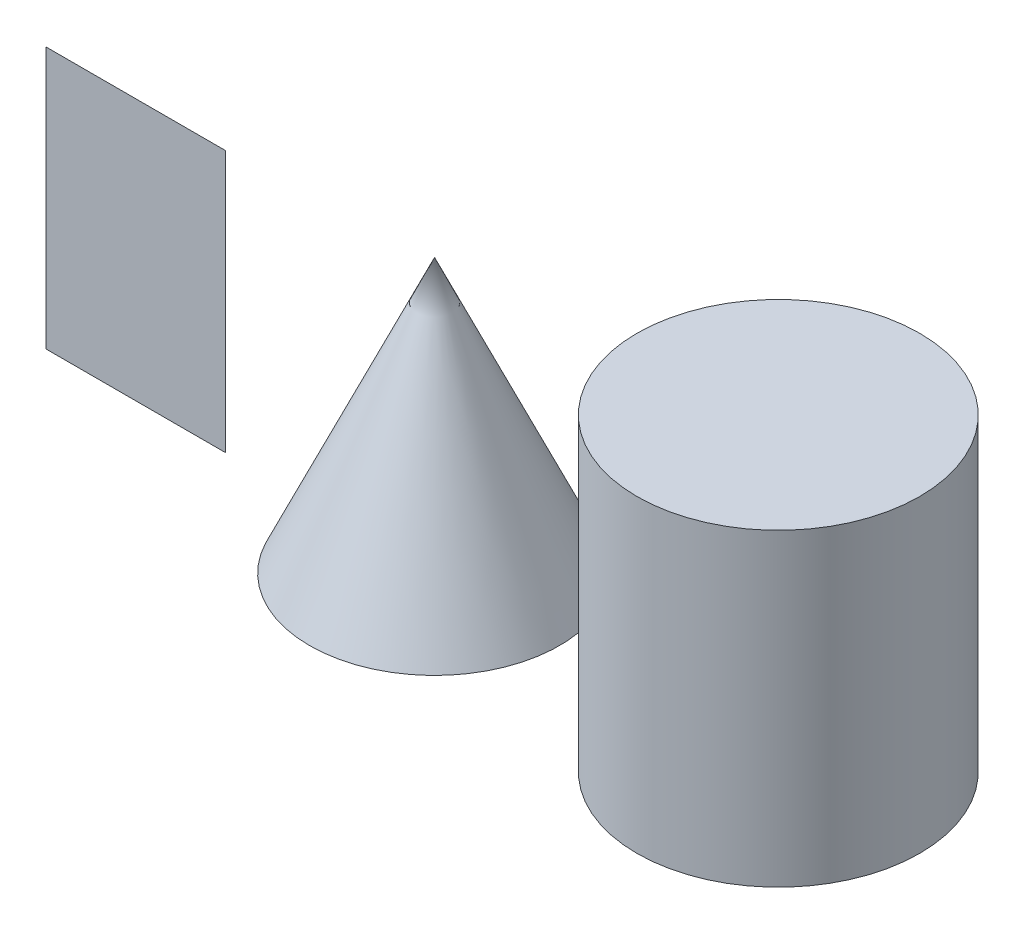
ISO-10303-21;
HEADER;
FILE_DESCRIPTION(('STEP AP214'),'2;1');
FILE_NAME('part.step','',(''),(''),'','','');
FILE_SCHEMA(('AUTOMOTIVE_DESIGN { 1 0 10303 214 1 1 1 1 }'));
ENDSEC;
DATA;
#1=APPLICATION_CONTEXT('core data for automotive mechanical design processes');
#2=APPLICATION_PROTOCOL_DEFINITION('international standard','automotive_design',2000,#1);
#3=PRODUCT_CONTEXT('',#1,'mechanical');
#4=PRODUCT('Part','Part','',(#3));
#5=PRODUCT_RELATED_PRODUCT_CATEGORY('part','',(#4));
#6=PRODUCT_DEFINITION_FORMATION('','',#4);
#7=PRODUCT_DEFINITION_CONTEXT('part definition',#1,'design');
#8=PRODUCT_DEFINITION('design','',#6,#7);
#9=PRODUCT_DEFINITION_SHAPE('','',#8);
#10=(LENGTH_UNIT() NAMED_UNIT(*) SI_UNIT(.MILLI.,.METRE.));
#11=(NAMED_UNIT(*) PLANE_ANGLE_UNIT() SI_UNIT($,.RADIAN.));
#12=(NAMED_UNIT(*) SI_UNIT($,.STERADIAN.) SOLID_ANGLE_UNIT());
#13=UNCERTAINTY_MEASURE_WITH_UNIT(LENGTH_MEASURE(1.E-05),#10,'distance_accuracy_value','');
#14=(GEOMETRIC_REPRESENTATION_CONTEXT(3) GLOBAL_UNCERTAINTY_ASSIGNED_CONTEXT((#13)) GLOBAL_UNIT_ASSIGNED_CONTEXT((#10,
#11,#12)) REPRESENTATION_CONTEXT('',''));
#15=CARTESIAN_POINT('',(0.,0.,0.));
#16=DIRECTION('',(0.,0.,1.));
#17=DIRECTION('',(1.,0.,0.));
#18=AXIS2_PLACEMENT_3D('',#15,#16,#17);
#19=CARTESIAN_POINT('',(114.659475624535,0.,0.));
#20=DIRECTION('',(0.,-1.,0.));
#21=DIRECTION('',(0.,0.,-1.));
#22=AXIS2_PLACEMENT_3D('',#19,#20,#21);
#23=PLANE('',#22);
#24=CARTESIAN_POINT('',(114.659475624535,0.,0.));
#25=DIRECTION('',(0.,1.,0.));
#26=DIRECTION('',(0.,0.,1.));
#27=AXIS2_PLACEMENT_3D('',#24,#25,#26);
#28=CIRCLE('',#27,22.1380148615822);
#29=CARTESIAN_POINT('',(114.659475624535,0.,22.1380148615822));
#30=VERTEX_POINT('',#29);
#31=EDGE_CURVE('E11',#30,#30,#28,.T.);
#32=ORIENTED_EDGE('',*,*,#31,.F.);
#33=EDGE_LOOP('',(#32));
#34=FACE_BOUND('',#33,.T.);
#35=ADVANCED_FACE('F45',(#34),#23,.T.);
#36=CARTESIAN_POINT('',(114.659475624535,48.3957694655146,0.));
#37=DIRECTION('',(0.,1.,0.));
#38=DIRECTION('',(0.,0.,1.));
#39=AXIS2_PLACEMENT_3D('',#36,#37,#38);
#40=CYLINDRICAL_SURFACE('',#39,22.1380148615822);
#41=ORIENTED_EDGE('',*,*,#31,.T.);
#42=EDGE_LOOP('',(#41));
#43=FACE_BOUND('',#42,.T.);
#44=CARTESIAN_POINT('',(114.659475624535,48.3957694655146,0.));
#45=DIRECTION('',(0.,1.,0.));
#46=DIRECTION('',(0.,0.,1.));
#47=AXIS2_PLACEMENT_3D('',#44,#45,#46);
#48=CIRCLE('',#47,22.1380148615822);
#49=CARTESIAN_POINT('',(114.659475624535,48.3957694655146,22.1380148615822));
#50=VERTEX_POINT('',#49);
#51=EDGE_CURVE('E51',#50,#50,#48,.T.);
#52=ORIENTED_EDGE('',*,*,#51,.F.);
#53=EDGE_LOOP('',(#52));
#54=FACE_BOUND('',#53,.T.);
#55=ADVANCED_FACE('F59',(#43,#54),#40,.T.);
#56=CARTESIAN_POINT('',(114.659475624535,48.3957694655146,0.));
#57=DIRECTION('',(0.,1.,0.));
#58=DIRECTION('',(0.,0.,1.));
#59=AXIS2_PLACEMENT_3D('',#56,#57,#58);
#60=PLANE('',#59);
#61=ORIENTED_EDGE('',*,*,#51,.T.);
#62=EDGE_LOOP('',(#61));
#63=FACE_BOUND('',#62,.T.);
#64=ADVANCED_FACE('F57',(#63),#60,.T.);
#65=CLOSED_SHELL('',(#35,#55,#64));
#66=MANIFOLD_SOLID_BREP('B2',#65);
#67=CARTESIAN_POINT('',(60.8376131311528,42.8389691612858,0.));
#68=DIRECTION('',(0.,-1.,0.));
#69=DIRECTION('',(0.,0.,-1.));
#70=AXIS2_PLACEMENT_3D('',#67,#68,#69);
#71=CONICAL_SURFACE('',#70,0.,0.428859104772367);
#72=CARTESIAN_POINT('',(60.8376131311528,0.,0.));
#73=DIRECTION('',(0.,1.,0.));
#74=DIRECTION('',(0.,0.,1.));
#75=AXIS2_PLACEMENT_3D('',#72,#73,#74);
#76=CIRCLE('',#75,19.587728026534);
#77=CARTESIAN_POINT('',(60.8376131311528,0.,19.587728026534));
#78=VERTEX_POINT('',#77);
#79=EDGE_CURVE('E43',#78,#78,#76,.T.);
#80=ORIENTED_EDGE('',*,*,#79,.T.);
#81=EDGE_LOOP('',(#80));
#82=FACE_BOUND('',#81,.T.);
#83=CARTESIAN_POINT('',(60.8376131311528,42.8389691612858,0.));
#84=VERTEX_POINT('',#83);
#85=VERTEX_LOOP('',#84);
#86=FACE_BOUND('',#85,.T.);
#87=ADVANCED_FACE('F94',(#82,#86),#71,.T.);
#88=CARTESIAN_POINT('',(60.8376131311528,0.,0.));
#89=DIRECTION('',(0.,-1.,0.));
#90=DIRECTION('',(0.,0.,-1.));
#91=AXIS2_PLACEMENT_3D('',#88,#89,#90);
#92=PLANE('',#91);
#93=ORIENTED_EDGE('',*,*,#79,.F.);
#94=EDGE_LOOP('',(#93));
#95=FACE_BOUND('',#94,.T.);
#96=ADVANCED_FACE('F102',(#95),#92,.T.);
#97=CLOSED_SHELL('',(#87,#96));
#98=MANIFOLD_SOLID_BREP('B6',#97);
#99=CARTESIAN_POINT('',(0.,40.9606938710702,0.));
#100=DIRECTION('',(0.,0.,-1.));
#101=DIRECTION('',(-1.,0.,0.));
#102=AXIS2_PLACEMENT_3D('',#99,#100,#101);
#103=PLANE('',#102);
#104=DIRECTION('',(0.,-1.,0.));
#105=VECTOR('',#104,1.);
#106=CARTESIAN_POINT('',(0.,0.,0.));
#107=LINE('',#106,#105);
#108=CARTESIAN_POINT('',(0.,40.9606938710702,0.));
#109=VERTEX_POINT('',#108);
#110=CARTESIAN_POINT('',(0.,0.,0.));
#111=VERTEX_POINT('',#110);
#112=EDGE_CURVE('E130',#109,#111,#107,.T.);
#113=ORIENTED_EDGE('',*,*,#112,.T.);
#114=DIRECTION('',(1.,0.,0.));
#115=VECTOR('',#114,1.);
#116=CARTESIAN_POINT('',(0.,0.,0.));
#117=LINE('',#116,#115);
#118=CARTESIAN_POINT('',(28.1019580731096,0.,0.));
#119=VERTEX_POINT('',#118);
#120=EDGE_CURVE('E141',#111,#119,#117,.T.);
#121=ORIENTED_EDGE('',*,*,#120,.T.);
#122=DIRECTION('',(0.,1.,0.));
#123=VECTOR('',#122,1.);
#124=CARTESIAN_POINT('',(28.1019580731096,0.,0.));
#125=LINE('',#124,#123);
#126=CARTESIAN_POINT('',(28.1019580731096,40.9606938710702,0.));
#127=VERTEX_POINT('',#126);
#128=EDGE_CURVE('E126',#119,#127,#125,.T.);
#129=ORIENTED_EDGE('',*,*,#128,.T.);
#130=DIRECTION('',(-1.,0.,0.));
#131=VECTOR('',#130,1.);
#132=CARTESIAN_POINT('',(0.,40.9606938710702,0.));
#133=LINE('',#132,#131);
#134=EDGE_CURVE('E92',#127,#109,#133,.T.);
#135=ORIENTED_EDGE('',*,*,#134,.T.);
#136=EDGE_LOOP('',(#113,#121,#129,#135));
#137=FACE_BOUND('',#136,.T.);
#138=ADVANCED_FACE('F121',(#137),#103,.F.);
#139=OPEN_SHELL('',(#138));
#140=SHELL_BASED_SURFACE_MODEL('B37',(#139));
#141=ADVANCED_BREP_SHAPE_REPRESENTATION('',(#18,#66,#98),#14);
#142=MANIFOLD_SURFACE_SHAPE_REPRESENTATION('',(#18,#140),#14);
#143=SHAPE_REPRESENTATION('',(#18),#14);
#144=SHAPE_DEFINITION_REPRESENTATION(#9,#143);
#145=SHAPE_REPRESENTATION_RELATIONSHIP('','',#143,#141);
#146=SHAPE_REPRESENTATION_RELATIONSHIP('','',#143,#142);
ENDSEC;
END-ISO-10303-21;
